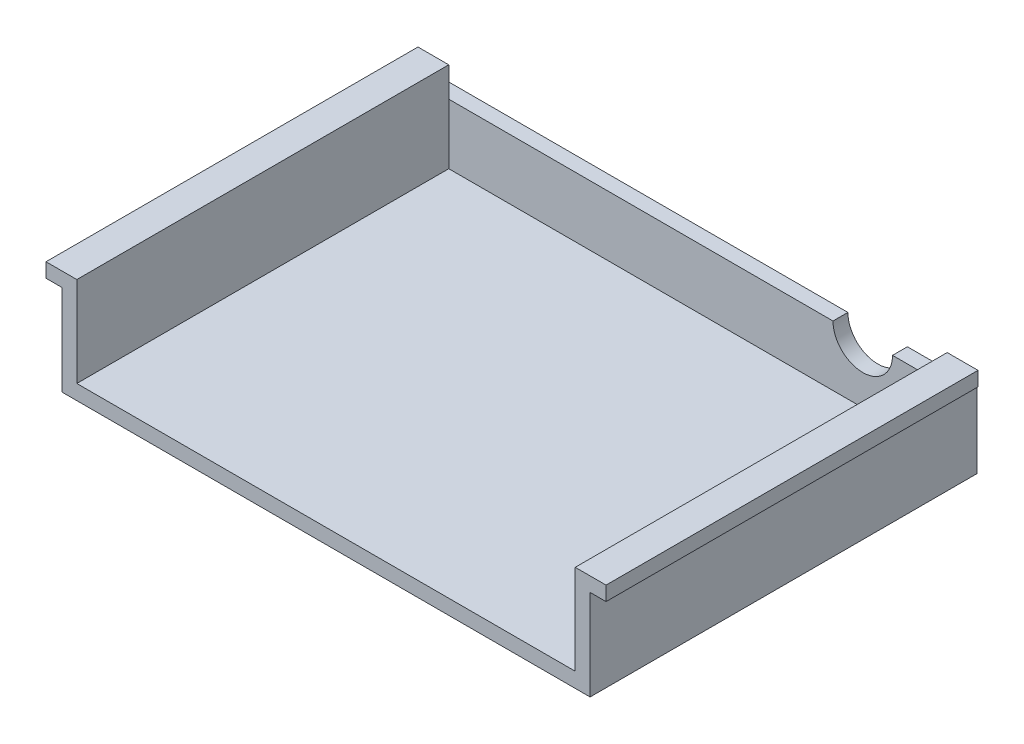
ISO-10303-21;
HEADER;
FILE_DESCRIPTION(('STEP AP214'),'2;1');
FILE_NAME('part.step','',(''),(''),'','','');
FILE_SCHEMA(('AUTOMOTIVE_DESIGN { 1 0 10303 214 1 1 1 1 }'));
ENDSEC;
DATA;
#1=APPLICATION_CONTEXT('core data for automotive mechanical design processes');
#2=APPLICATION_PROTOCOL_DEFINITION('international standard','automotive_design',2000,#1);
#3=PRODUCT_CONTEXT('',#1,'mechanical');
#4=PRODUCT('Part','Part','',(#3));
#5=PRODUCT_RELATED_PRODUCT_CATEGORY('part','',(#4));
#6=PRODUCT_DEFINITION_FORMATION('','',#4);
#7=PRODUCT_DEFINITION_CONTEXT('part definition',#1,'design');
#8=PRODUCT_DEFINITION('design','',#6,#7);
#9=PRODUCT_DEFINITION_SHAPE('','',#8);
#10=(LENGTH_UNIT() NAMED_UNIT(*) SI_UNIT(.MILLI.,.METRE.));
#11=(NAMED_UNIT(*) PLANE_ANGLE_UNIT() SI_UNIT($,.RADIAN.));
#12=(NAMED_UNIT(*) SI_UNIT($,.STERADIAN.) SOLID_ANGLE_UNIT());
#13=UNCERTAINTY_MEASURE_WITH_UNIT(LENGTH_MEASURE(1.E-05),#10,'distance_accuracy_value','');
#14=(GEOMETRIC_REPRESENTATION_CONTEXT(3) GLOBAL_UNCERTAINTY_ASSIGNED_CONTEXT((#13)) GLOBAL_UNIT_ASSIGNED_CONTEXT((#10,
#11,#12)) REPRESENTATION_CONTEXT('',''));
#15=CARTESIAN_POINT('',(0.,0.,0.));
#16=DIRECTION('',(0.,0.,1.));
#17=DIRECTION('',(1.,0.,0.));
#18=AXIS2_PLACEMENT_3D('',#15,#16,#17);
#19=CARTESIAN_POINT('',(-45.4975985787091,1.42388253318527,-1.016));
#20=DIRECTION('',(0.,-1.,0.));
#21=DIRECTION('',(0.,0.,-1.));
#22=AXIS2_PLACEMENT_3D('',#19,#20,#21);
#23=PLANE('',#22);
#24=DIRECTION('',(1.,0.,0.));
#25=VECTOR('',#24,1.);
#26=CARTESIAN_POINT('',(-45.4975985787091,1.42388253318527,0.));
#27=LINE('',#26,#25);
#28=CARTESIAN_POINT('',(-32.1102128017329,1.42388253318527,0.));
#29=VERTEX_POINT('',#28);
#30=CARTESIAN_POINT('',(-5.87201280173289,1.42388253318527,0.));
#31=VERTEX_POINT('',#30);
#32=EDGE_CURVE('E166',#29,#31,#27,.T.);
#33=ORIENTED_EDGE('',*,*,#32,.T.);
#34=DIRECTION('',(0.,0.,-1.));
#35=VECTOR('',#34,1.);
#36=CARTESIAN_POINT('',(-5.87201280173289,1.42388253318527,2.032));
#37=LINE('',#36,#35);
#38=CARTESIAN_POINT('',(-5.87201280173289,1.42388253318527,-1.016));
#39=VERTEX_POINT('',#38);
#40=EDGE_CURVE('E153',#31,#39,#37,.T.);
#41=ORIENTED_EDGE('',*,*,#40,.T.);
#42=DIRECTION('',(1.,0.,0.));
#43=VECTOR('',#42,1.);
#44=CARTESIAN_POINT('',(-45.4975985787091,1.42388253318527,-1.016));
#45=LINE('',#44,#43);
#46=CARTESIAN_POINT('',(-33.1262128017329,1.42388253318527,-1.016));
#47=VERTEX_POINT('',#46);
#48=EDGE_CURVE('E163',#47,#39,#45,.T.);
#49=ORIENTED_EDGE('',*,*,#48,.F.);
#50=DIRECTION('',(0.,0.,1.));
#51=VECTOR('',#50,1.);
#52=CARTESIAN_POINT('',(-33.1262128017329,1.42388253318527,-1.016));
#53=LINE('',#52,#51);
#54=CARTESIAN_POINT('',(-33.1262128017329,1.42388253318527,0.));
#55=VERTEX_POINT('',#54);
#56=EDGE_CURVE('E186',#47,#55,#53,.T.);
#57=ORIENTED_EDGE('',*,*,#56,.T.);
#58=EDGE_CURVE('E180',#55,#29,#27,.T.);
#59=ORIENTED_EDGE('',*,*,#58,.T.);
#60=EDGE_LOOP('',(#33,#41,#49,#57,#59));
#61=FACE_BOUND('',#60,.T.);
#62=ADVANCED_FACE('F32',(#61),#23,.F.);
#63=CARTESIAN_POINT('',(-15.0922128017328,-30.530903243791,0.));
#64=DIRECTION('',(0.,0.,1.));
#65=DIRECTION('',(1.,0.,0.));
#66=AXIS2_PLACEMENT_3D('',#63,#64,#65);
#67=PLANE('',#66);
#68=ORIENTED_EDGE('',*,*,#58,.F.);
#69=DIRECTION('',(0.,1.,0.));
#70=VECTOR('',#69,1.);
#71=CARTESIAN_POINT('',(-33.1262128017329,-30.530903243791,0.));
#72=LINE('',#71,#70);
#73=CARTESIAN_POINT('',(-33.1262128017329,2.47857453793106,0.));
#74=VERTEX_POINT('',#73);
#75=EDGE_CURVE('E223',#55,#74,#72,.T.);
#76=ORIENTED_EDGE('',*,*,#75,.T.);
#77=DIRECTION('',(1.,0.,0.));
#78=VECTOR('',#77,1.);
#79=CARTESIAN_POINT('',(-15.0922128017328,2.47857453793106,0.));
#80=LINE('',#79,#78);
#81=CARTESIAN_POINT('',(-34.2141312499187,2.47857453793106,0.));
#82=VERTEX_POINT('',#81);
#83=EDGE_CURVE('E220',#82,#74,#80,.T.);
#84=ORIENTED_EDGE('',*,*,#83,.F.);
#85=DIRECTION('',(0.,-1.,0.));
#86=VECTOR('',#85,1.);
#87=CARTESIAN_POINT('',(-34.2141312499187,-30.530903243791,0.));
#88=LINE('',#87,#86);
#89=CARTESIAN_POINT('',(-34.2141312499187,3.45588253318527,0.));
#90=VERTEX_POINT('',#89);
#91=EDGE_CURVE('E218',#90,#82,#88,.T.);
#92=ORIENTED_EDGE('',*,*,#91,.F.);
#93=DIRECTION('',(1.,0.,0.));
#94=VECTOR('',#93,1.);
#95=CARTESIAN_POINT('',(-15.0922128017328,3.45588253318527,0.));
#96=LINE('',#95,#94);
#97=CARTESIAN_POINT('',(-32.1102128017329,3.45588253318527,0.));
#98=VERTEX_POINT('',#97);
#99=EDGE_CURVE('E216',#90,#98,#96,.T.);
#100=ORIENTED_EDGE('',*,*,#99,.T.);
#101=DIRECTION('',(0.,1.,0.));
#102=VECTOR('',#101,1.);
#103=CARTESIAN_POINT('',(-32.1102128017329,-30.530903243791,0.));
#104=LINE('',#103,#102);
#105=EDGE_CURVE('E57',#29,#98,#104,.T.);
#106=ORIENTED_EDGE('',*,*,#105,.F.);
#107=EDGE_LOOP('',(#68,#76,#84,#92,#100,#106));
#108=FACE_BOUND('',#107,.T.);
#109=ADVANCED_FACE('F334',(#108),#67,.F.);
#110=CARTESIAN_POINT('',(1.9257871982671,1.42388253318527,0.));
#111=VERTEX_POINT('',#110);
#112=CARTESIAN_POINT('',(2.94178719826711,1.42388253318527,0.));
#113=VERTEX_POINT('',#112);
#114=EDGE_CURVE('E11',#111,#113,#27,.T.);
#115=ORIENTED_EDGE('',*,*,#114,.F.);
#116=DIRECTION('',(0.,1.,0.));
#117=VECTOR('',#116,1.);
#118=CARTESIAN_POINT('',(1.9257871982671,-30.530903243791,0.));
#119=LINE('',#118,#117);
#120=CARTESIAN_POINT('',(1.9257871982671,3.45588253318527,0.));
#121=VERTEX_POINT('',#120);
#122=EDGE_CURVE('E262',#111,#121,#119,.T.);
#123=ORIENTED_EDGE('',*,*,#122,.T.);
#124=DIRECTION('',(-1.,0.,0.));
#125=VECTOR('',#124,1.);
#126=CARTESIAN_POINT('',(-15.0922128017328,3.45588253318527,0.));
#127=LINE('',#126,#125);
#128=CARTESIAN_POINT('',(4.02970564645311,3.45588253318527,0.));
#129=VERTEX_POINT('',#128);
#130=EDGE_CURVE('E263',#129,#121,#127,.T.);
#131=ORIENTED_EDGE('',*,*,#130,.F.);
#132=DIRECTION('',(0.,-1.,0.));
#133=VECTOR('',#132,1.);
#134=CARTESIAN_POINT('',(4.02970564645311,-30.530903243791,0.));
#135=LINE('',#134,#133);
#136=CARTESIAN_POINT('',(4.02970564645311,2.47857453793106,0.));
#137=VERTEX_POINT('',#136);
#138=EDGE_CURVE('E266',#129,#137,#135,.T.);
#139=ORIENTED_EDGE('',*,*,#138,.T.);
#140=DIRECTION('',(-1.,0.,0.));
#141=VECTOR('',#140,1.);
#142=CARTESIAN_POINT('',(-15.0922128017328,2.47857453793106,0.));
#143=LINE('',#142,#141);
#144=CARTESIAN_POINT('',(2.94178719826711,2.47857453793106,0.));
#145=VERTEX_POINT('',#144);
#146=EDGE_CURVE('E231',#137,#145,#143,.T.);
#147=ORIENTED_EDGE('',*,*,#146,.T.);
#148=DIRECTION('',(0.,1.,0.));
#149=VECTOR('',#148,1.);
#150=CARTESIAN_POINT('',(2.94178719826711,-30.530903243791,0.));
#151=LINE('',#150,#149);
#152=EDGE_CURVE('E229',#113,#145,#151,.T.);
#153=ORIENTED_EDGE('',*,*,#152,.F.);
#154=EDGE_LOOP('',(#115,#123,#131,#139,#147,#153));
#155=FACE_BOUND('',#154,.T.);
#156=ADVANCED_FACE('F272',(#155),#67,.F.);
#157=CARTESIAN_POINT('',(-15.0922128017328,-2.69091746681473,25.4));
#158=DIRECTION('',(0.,1.,0.));
#159=DIRECTION('',(0.,0.,1.));
#160=AXIS2_PLACEMENT_3D('',#157,#158,#159);
#161=PLANE('',#160);
#162=DIRECTION('',(1.,0.,0.));
#163=VECTOR('',#162,1.);
#164=CARTESIAN_POINT('',(-15.0922128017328,-2.69091746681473,0.));
#165=LINE('',#164,#163);
#166=CARTESIAN_POINT('',(-32.1102128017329,-2.69091746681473,0.));
#167=VERTEX_POINT('',#166);
#168=CARTESIAN_POINT('',(1.9257871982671,-2.69091746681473,0.));
#169=VERTEX_POINT('',#168);
#170=EDGE_CURVE('E200',#167,#169,#165,.T.);
#171=ORIENTED_EDGE('',*,*,#170,.F.);
#172=DIRECTION('',(0.,0.,-1.));
#173=VECTOR('',#172,1.);
#174=CARTESIAN_POINT('',(-32.1102128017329,-2.69091746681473,25.4));
#175=LINE('',#174,#173);
#176=CARTESIAN_POINT('',(-32.1102128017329,-2.69091746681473,25.4));
#177=VERTEX_POINT('',#176);
#178=EDGE_CURVE('E41',#177,#167,#175,.T.);
#179=ORIENTED_EDGE('',*,*,#178,.F.);
#180=DIRECTION('',(1.,0.,0.));
#181=VECTOR('',#180,1.);
#182=CARTESIAN_POINT('',(-15.0922128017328,-2.69091746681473,25.4));
#183=LINE('',#182,#181);
#184=CARTESIAN_POINT('',(1.9257871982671,-2.69091746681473,25.4));
#185=VERTEX_POINT('',#184);
#186=EDGE_CURVE('E190',#177,#185,#183,.T.);
#187=ORIENTED_EDGE('',*,*,#186,.T.);
#188=DIRECTION('',(0.,0.,-1.));
#189=VECTOR('',#188,1.);
#190=CARTESIAN_POINT('',(1.9257871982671,-2.69091746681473,25.4));
#191=LINE('',#190,#189);
#192=EDGE_CURVE('E258',#185,#169,#191,.T.);
#193=ORIENTED_EDGE('',*,*,#192,.T.);
#194=EDGE_LOOP('',(#171,#179,#187,#193));
#195=FACE_BOUND('',#194,.T.);
#196=ADVANCED_FACE('F34',(#195),#161,.T.);
#197=CARTESIAN_POINT('',(-32.1102128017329,-30.530903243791,25.4));
#198=DIRECTION('',(-1.,0.,0.));
#199=DIRECTION('',(0.,0.,1.));
#200=AXIS2_PLACEMENT_3D('',#197,#198,#199);
#201=PLANE('',#200);
#202=EDGE_CURVE('E210',#167,#29,#104,.T.);
#203=ORIENTED_EDGE('',*,*,#202,.T.);
#204=ORIENTED_EDGE('',*,*,#105,.T.);
#205=DIRECTION('',(0.,0.,-1.));
#206=VECTOR('',#205,1.);
#207=CARTESIAN_POINT('',(-32.1102128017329,3.45588253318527,25.4));
#208=LINE('',#207,#206);
#209=CARTESIAN_POINT('',(-32.1102128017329,3.45588253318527,25.4));
#210=VERTEX_POINT('',#209);
#211=EDGE_CURVE('E233',#210,#98,#208,.T.);
#212=ORIENTED_EDGE('',*,*,#211,.F.);
#213=DIRECTION('',(0.,1.,0.));
#214=VECTOR('',#213,1.);
#215=CARTESIAN_POINT('',(-32.1102128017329,-30.530903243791,25.4));
#216=LINE('',#215,#214);
#217=EDGE_CURVE('E310',#177,#210,#216,.T.);
#218=ORIENTED_EDGE('',*,*,#217,.F.);
#219=ORIENTED_EDGE('',*,*,#178,.T.);
#220=EDGE_LOOP('',(#203,#204,#212,#218,#219));
#221=FACE_BOUND('',#220,.T.);
#222=ADVANCED_FACE('F340',(#221),#201,.F.);
#223=CARTESIAN_POINT('',(-15.0922128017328,3.45588253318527,25.4));
#224=DIRECTION('',(0.,1.,0.));
#225=DIRECTION('',(0.,0.,1.));
#226=AXIS2_PLACEMENT_3D('',#223,#224,#225);
#227=PLANE('',#226);
#228=ORIENTED_EDGE('',*,*,#99,.F.);
#229=DIRECTION('',(0.,0.,-1.));
#230=VECTOR('',#229,1.);
#231=CARTESIAN_POINT('',(-34.2141312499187,3.45588253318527,25.4));
#232=LINE('',#231,#230);
#233=CARTESIAN_POINT('',(-34.2141312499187,3.45588253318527,25.4));
#234=VERTEX_POINT('',#233);
#235=EDGE_CURVE('E236',#234,#90,#232,.T.);
#236=ORIENTED_EDGE('',*,*,#235,.F.);
#237=DIRECTION('',(1.,0.,0.));
#238=VECTOR('',#237,1.);
#239=CARTESIAN_POINT('',(-15.0922128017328,3.45588253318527,25.4));
#240=LINE('',#239,#238);
#241=EDGE_CURVE('E313',#234,#210,#240,.T.);
#242=ORIENTED_EDGE('',*,*,#241,.T.);
#243=ORIENTED_EDGE('',*,*,#211,.T.);
#244=EDGE_LOOP('',(#228,#236,#242,#243));
#245=FACE_BOUND('',#244,.T.);
#246=ADVANCED_FACE('F338',(#245),#227,.T.);
#247=CARTESIAN_POINT('',(-34.2141312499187,-30.530903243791,25.4));
#248=DIRECTION('',(1.,0.,0.));
#249=DIRECTION('',(0.,0.,-1.));
#250=AXIS2_PLACEMENT_3D('',#247,#248,#249);
#251=PLANE('',#250);
#252=ORIENTED_EDGE('',*,*,#91,.T.);
#253=DIRECTION('',(0.,0.,-1.));
#254=VECTOR('',#253,1.);
#255=CARTESIAN_POINT('',(-34.2141312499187,2.47857453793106,25.4));
#256=LINE('',#255,#254);
#257=CARTESIAN_POINT('',(-34.2141312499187,2.47857453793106,25.4));
#258=VERTEX_POINT('',#257);
#259=EDGE_CURVE('E238',#258,#82,#256,.T.);
#260=ORIENTED_EDGE('',*,*,#259,.F.);
#261=DIRECTION('',(0.,-1.,0.));
#262=VECTOR('',#261,1.);
#263=CARTESIAN_POINT('',(-34.2141312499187,-30.530903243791,25.4));
#264=LINE('',#263,#262);
#265=EDGE_CURVE('E315',#234,#258,#264,.T.);
#266=ORIENTED_EDGE('',*,*,#265,.F.);
#267=ORIENTED_EDGE('',*,*,#235,.T.);
#268=EDGE_LOOP('',(#252,#260,#266,#267));
#269=FACE_BOUND('',#268,.T.);
#270=ADVANCED_FACE('F495',(#269),#251,.F.);
#271=CARTESIAN_POINT('',(-15.0922128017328,2.47857453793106,25.4));
#272=DIRECTION('',(0.,1.,0.));
#273=DIRECTION('',(0.,0.,1.));
#274=AXIS2_PLACEMENT_3D('',#271,#272,#273);
#275=PLANE('',#274);
#276=ORIENTED_EDGE('',*,*,#83,.T.);
#277=DIRECTION('',(0.,0.,-1.));
#278=VECTOR('',#277,1.);
#279=CARTESIAN_POINT('',(-33.1262128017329,2.47857453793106,25.4));
#280=LINE('',#279,#278);
#281=CARTESIAN_POINT('',(-33.1262128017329,2.47857453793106,25.4));
#282=VERTEX_POINT('',#281);
#283=EDGE_CURVE('E241',#282,#74,#280,.T.);
#284=ORIENTED_EDGE('',*,*,#283,.F.);
#285=DIRECTION('',(1.,0.,0.));
#286=VECTOR('',#285,1.);
#287=CARTESIAN_POINT('',(-15.0922128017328,2.47857453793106,25.4));
#288=LINE('',#287,#286);
#289=EDGE_CURVE('E319',#258,#282,#288,.T.);
#290=ORIENTED_EDGE('',*,*,#289,.F.);
#291=ORIENTED_EDGE('',*,*,#259,.T.);
#292=EDGE_LOOP('',(#276,#284,#290,#291));
#293=FACE_BOUND('',#292,.T.);
#294=ADVANCED_FACE('F331',(#293),#275,.F.);
#295=CARTESIAN_POINT('',(-33.1262128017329,-30.530903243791,25.4));
#296=DIRECTION('',(-1.,0.,0.));
#297=DIRECTION('',(0.,0.,1.));
#298=AXIS2_PLACEMENT_3D('',#295,#296,#297);
#299=PLANE('',#298);
#300=ORIENTED_EDGE('',*,*,#75,.F.);
#301=ORIENTED_EDGE('',*,*,#56,.F.);
#302=DIRECTION('',(0.,1.,0.));
#303=VECTOR('',#302,1.);
#304=CARTESIAN_POINT('',(-33.1262128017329,-0.125517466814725,-1.016));
#305=LINE('',#304,#303);
#306=CARTESIAN_POINT('',(-33.1262128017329,-3.70691746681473,-1.016));
#307=VERTEX_POINT('',#306);
#308=EDGE_CURVE('E172',#307,#47,#305,.T.);
#309=ORIENTED_EDGE('',*,*,#308,.F.);
#310=DIRECTION('',(0.,0.,-1.));
#311=VECTOR('',#310,1.);
#312=CARTESIAN_POINT('',(-33.1262128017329,-3.70691746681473,25.4));
#313=LINE('',#312,#311);
#314=CARTESIAN_POINT('',(-33.1262128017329,-3.70691746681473,25.4));
#315=VERTEX_POINT('',#314);
#316=EDGE_CURVE('E244',#315,#307,#313,.T.);
#317=ORIENTED_EDGE('',*,*,#316,.F.);
#318=DIRECTION('',(0.,1.,0.));
#319=VECTOR('',#318,1.);
#320=CARTESIAN_POINT('',(-33.1262128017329,-30.530903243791,25.4));
#321=LINE('',#320,#319);
#322=EDGE_CURVE('E290',#315,#282,#321,.T.);
#323=ORIENTED_EDGE('',*,*,#322,.T.);
#324=ORIENTED_EDGE('',*,*,#283,.T.);
#325=EDGE_LOOP('',(#300,#301,#309,#317,#323,#324));
#326=FACE_BOUND('',#325,.T.);
#327=ADVANCED_FACE('F324',(#326),#299,.T.);
#328=CARTESIAN_POINT('',(-15.0922128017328,-3.70691746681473,25.4));
#329=DIRECTION('',(0.,1.,0.));
#330=DIRECTION('',(0.,0.,1.));
#331=AXIS2_PLACEMENT_3D('',#328,#329,#330);
#332=PLANE('',#331);
#333=ORIENTED_EDGE('',*,*,#316,.T.);
#334=DIRECTION('',(-1.,0.,0.));
#335=VECTOR('',#334,1.);
#336=CARTESIAN_POINT('',(-45.4975985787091,-3.70691746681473,-1.016));
#337=LINE('',#336,#335);
#338=CARTESIAN_POINT('',(2.94178719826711,-3.70691746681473,-1.016));
#339=VERTEX_POINT('',#338);
#340=EDGE_CURVE('E178',#339,#307,#337,.T.);
#341=ORIENTED_EDGE('',*,*,#340,.F.);
#342=DIRECTION('',(0.,0.,-1.));
#343=VECTOR('',#342,1.);
#344=CARTESIAN_POINT('',(2.94178719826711,-3.70691746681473,25.4));
#345=LINE('',#344,#343);
#346=CARTESIAN_POINT('',(2.94178719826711,-3.70691746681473,25.4));
#347=VERTEX_POINT('',#346);
#348=EDGE_CURVE('E246',#347,#339,#345,.T.);
#349=ORIENTED_EDGE('',*,*,#348,.F.);
#350=DIRECTION('',(1.,0.,0.));
#351=VECTOR('',#350,1.);
#352=CARTESIAN_POINT('',(-15.0922128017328,-3.70691746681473,25.4));
#353=LINE('',#352,#351);
#354=EDGE_CURVE('E286',#315,#347,#353,.T.);
#355=ORIENTED_EDGE('',*,*,#354,.F.);
#356=EDGE_LOOP('',(#333,#341,#349,#355));
#357=FACE_BOUND('',#356,.T.);
#358=ADVANCED_FACE('F413',(#357),#332,.F.);
#359=CARTESIAN_POINT('',(2.94178719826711,-30.530903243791,25.4));
#360=DIRECTION('',(-1.,0.,0.));
#361=DIRECTION('',(0.,0.,1.));
#362=AXIS2_PLACEMENT_3D('',#359,#360,#361);
#363=PLANE('',#362);
#364=ORIENTED_EDGE('',*,*,#348,.T.);
#365=DIRECTION('',(0.,-1.,0.));
#366=VECTOR('',#365,1.);
#367=CARTESIAN_POINT('',(2.94178719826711,-0.125517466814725,-1.016));
#368=LINE('',#367,#366);
#369=CARTESIAN_POINT('',(2.94178719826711,1.42388253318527,-1.016));
#370=VERTEX_POINT('',#369);
#371=EDGE_CURVE('E174',#370,#339,#368,.T.);
#372=ORIENTED_EDGE('',*,*,#371,.F.);
#373=DIRECTION('',(0.,0.,1.));
#374=VECTOR('',#373,1.);
#375=CARTESIAN_POINT('',(2.94178719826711,1.42388253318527,-1.016));
#376=LINE('',#375,#374);
#377=EDGE_CURVE('E198',#370,#113,#376,.T.);
#378=ORIENTED_EDGE('',*,*,#377,.T.);
#379=ORIENTED_EDGE('',*,*,#152,.T.);
#380=DIRECTION('',(0.,0.,-1.));
#381=VECTOR('',#380,1.);
#382=CARTESIAN_POINT('',(2.94178719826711,2.47857453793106,25.4));
#383=LINE('',#382,#381);
#384=CARTESIAN_POINT('',(2.94178719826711,2.47857453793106,25.4));
#385=VERTEX_POINT('',#384);
#386=EDGE_CURVE('E248',#385,#145,#383,.T.);
#387=ORIENTED_EDGE('',*,*,#386,.F.);
#388=DIRECTION('',(0.,1.,0.));
#389=VECTOR('',#388,1.);
#390=CARTESIAN_POINT('',(2.94178719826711,-30.530903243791,25.4));
#391=LINE('',#390,#389);
#392=EDGE_CURVE('E283',#347,#385,#391,.T.);
#393=ORIENTED_EDGE('',*,*,#392,.F.);
#394=EDGE_LOOP('',(#364,#372,#378,#379,#387,#393));
#395=FACE_BOUND('',#394,.T.);
#396=ADVANCED_FACE('F282',(#395),#363,.F.);
#397=CARTESIAN_POINT('',(-15.0922128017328,2.47857453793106,25.4));
#398=DIRECTION('',(0.,-1.,0.));
#399=DIRECTION('',(0.,0.,-1.));
#400=AXIS2_PLACEMENT_3D('',#397,#398,#399);
#401=PLANE('',#400);
#402=ORIENTED_EDGE('',*,*,#146,.F.);
#403=DIRECTION('',(0.,0.,-1.));
#404=VECTOR('',#403,1.);
#405=CARTESIAN_POINT('',(4.02970564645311,2.47857453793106,25.4));
#406=LINE('',#405,#404);
#407=CARTESIAN_POINT('',(4.02970564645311,2.47857453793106,25.4));
#408=VERTEX_POINT('',#407);
#409=EDGE_CURVE('E251',#408,#137,#406,.T.);
#410=ORIENTED_EDGE('',*,*,#409,.F.);
#411=DIRECTION('',(-1.,0.,0.));
#412=VECTOR('',#411,1.);
#413=CARTESIAN_POINT('',(-15.0922128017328,2.47857453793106,25.4));
#414=LINE('',#413,#412);
#415=EDGE_CURVE('E280',#408,#385,#414,.T.);
#416=ORIENTED_EDGE('',*,*,#415,.T.);
#417=ORIENTED_EDGE('',*,*,#386,.T.);
#418=EDGE_LOOP('',(#402,#410,#416,#417));
#419=FACE_BOUND('',#418,.T.);
#420=ADVANCED_FACE('F276',(#419),#401,.T.);
#421=CARTESIAN_POINT('',(4.02970564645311,-30.530903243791,25.4));
#422=DIRECTION('',(1.,0.,0.));
#423=DIRECTION('',(0.,0.,-1.));
#424=AXIS2_PLACEMENT_3D('',#421,#422,#423);
#425=PLANE('',#424);
#426=ORIENTED_EDGE('',*,*,#138,.F.);
#427=DIRECTION('',(0.,0.,-1.));
#428=VECTOR('',#427,1.);
#429=CARTESIAN_POINT('',(4.02970564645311,3.45588253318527,25.4));
#430=LINE('',#429,#428);
#431=CARTESIAN_POINT('',(4.02970564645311,3.45588253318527,25.4));
#432=VERTEX_POINT('',#431);
#433=EDGE_CURVE('E253',#432,#129,#430,.T.);
#434=ORIENTED_EDGE('',*,*,#433,.F.);
#435=DIRECTION('',(0.,-1.,0.));
#436=VECTOR('',#435,1.);
#437=CARTESIAN_POINT('',(4.02970564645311,-30.530903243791,25.4));
#438=LINE('',#437,#436);
#439=EDGE_CURVE('E288',#432,#408,#438,.T.);
#440=ORIENTED_EDGE('',*,*,#439,.T.);
#441=ORIENTED_EDGE('',*,*,#409,.T.);
#442=EDGE_LOOP('',(#426,#434,#440,#441));
#443=FACE_BOUND('',#442,.T.);
#444=ADVANCED_FACE('F347',(#443),#425,.T.);
#445=CARTESIAN_POINT('',(-15.0922128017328,3.45588253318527,25.4));
#446=DIRECTION('',(0.,-1.,0.));
#447=DIRECTION('',(0.,0.,-1.));
#448=AXIS2_PLACEMENT_3D('',#445,#446,#447);
#449=PLANE('',#448);
#450=ORIENTED_EDGE('',*,*,#130,.T.);
#451=DIRECTION('',(0.,0.,-1.));
#452=VECTOR('',#451,1.);
#453=CARTESIAN_POINT('',(1.9257871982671,3.45588253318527,25.4));
#454=LINE('',#453,#452);
#455=CARTESIAN_POINT('',(1.9257871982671,3.45588253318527,25.4));
#456=VERTEX_POINT('',#455);
#457=EDGE_CURVE('E255',#456,#121,#454,.T.);
#458=ORIENTED_EDGE('',*,*,#457,.F.);
#459=DIRECTION('',(-1.,0.,0.));
#460=VECTOR('',#459,1.);
#461=CARTESIAN_POINT('',(-15.0922128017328,3.45588253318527,25.4));
#462=LINE('',#461,#460);
#463=EDGE_CURVE('E295',#432,#456,#462,.T.);
#464=ORIENTED_EDGE('',*,*,#463,.F.);
#465=ORIENTED_EDGE('',*,*,#433,.T.);
#466=EDGE_LOOP('',(#450,#458,#464,#465));
#467=FACE_BOUND('',#466,.T.);
#468=ADVANCED_FACE('F348',(#467),#449,.F.);
#469=CARTESIAN_POINT('',(1.9257871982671,-30.530903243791,25.4));
#470=DIRECTION('',(-1.,0.,0.));
#471=DIRECTION('',(0.,0.,1.));
#472=AXIS2_PLACEMENT_3D('',#469,#470,#471);
#473=PLANE('',#472);
#474=EDGE_CURVE('E260',#169,#111,#119,.T.);
#475=ORIENTED_EDGE('',*,*,#474,.F.);
#476=ORIENTED_EDGE('',*,*,#192,.F.);
#477=DIRECTION('',(0.,1.,0.));
#478=VECTOR('',#477,1.);
#479=CARTESIAN_POINT('',(1.9257871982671,-30.530903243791,25.4));
#480=LINE('',#479,#478);
#481=EDGE_CURVE('E213',#185,#456,#480,.T.);
#482=ORIENTED_EDGE('',*,*,#481,.T.);
#483=ORIENTED_EDGE('',*,*,#457,.T.);
#484=ORIENTED_EDGE('',*,*,#122,.F.);
#485=EDGE_LOOP('',(#475,#476,#482,#483,#484));
#486=FACE_BOUND('',#485,.T.);
#487=ADVANCED_FACE('F303',(#486),#473,.T.);
#488=CARTESIAN_POINT('',(-15.0922128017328,-30.530903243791,25.4));
#489=DIRECTION('',(0.,0.,1.));
#490=DIRECTION('',(1.,0.,0.));
#491=AXIS2_PLACEMENT_3D('',#488,#489,#490);
#492=PLANE('',#491);
#493=ORIENTED_EDGE('',*,*,#186,.F.);
#494=ORIENTED_EDGE('',*,*,#217,.T.);
#495=ORIENTED_EDGE('',*,*,#241,.F.);
#496=ORIENTED_EDGE('',*,*,#265,.T.);
#497=ORIENTED_EDGE('',*,*,#289,.T.);
#498=ORIENTED_EDGE('',*,*,#322,.F.);
#499=ORIENTED_EDGE('',*,*,#354,.T.);
#500=ORIENTED_EDGE('',*,*,#392,.T.);
#501=ORIENTED_EDGE('',*,*,#415,.F.);
#502=ORIENTED_EDGE('',*,*,#439,.F.);
#503=ORIENTED_EDGE('',*,*,#463,.T.);
#504=ORIENTED_EDGE('',*,*,#481,.F.);
#505=EDGE_LOOP('',(#493,#494,#495,#496,#497,#498,#499,#500,#501,#502,#503,#504));
#506=FACE_BOUND('',#505,.T.);
#507=ADVANCED_FACE('F307',(#506),#492,.T.);
#508=CARTESIAN_POINT('',(-45.4975985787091,-0.125517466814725,0.));
#509=DIRECTION('',(0.,0.,-1.));
#510=DIRECTION('',(-1.,0.,0.));
#511=AXIS2_PLACEMENT_3D('',#508,#509,#510);
#512=PLANE('',#511);
#513=CARTESIAN_POINT('',(-1.8080128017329,1.42388253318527,0.));
#514=VERTEX_POINT('',#513);
#515=EDGE_CURVE('E189',#514,#111,#27,.T.);
#516=ORIENTED_EDGE('',*,*,#515,.F.);
#517=CARTESIAN_POINT('',(-3.84001280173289,1.42388253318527,0.));
#518=DIRECTION('',(0.,0.,-1.));
#519=DIRECTION('',(-1.,0.,0.));
#520=AXIS2_PLACEMENT_3D('',#517,#518,#519);
#521=CIRCLE('',#520,2.032);
#522=EDGE_CURVE('E167',#514,#31,#521,.T.);
#523=ORIENTED_EDGE('',*,*,#522,.T.);
#524=ORIENTED_EDGE('',*,*,#32,.F.);
#525=ORIENTED_EDGE('',*,*,#202,.F.);
#526=ORIENTED_EDGE('',*,*,#170,.T.);
#527=ORIENTED_EDGE('',*,*,#474,.T.);
#528=EDGE_LOOP('',(#516,#523,#524,#525,#526,#527));
#529=FACE_BOUND('',#528,.T.);
#530=ADVANCED_FACE('F342',(#529),#512,.F.);
#531=CARTESIAN_POINT('',(-1.8080128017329,1.42388253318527,-1.016));
#532=VERTEX_POINT('',#531);
#533=EDGE_CURVE('E175',#532,#370,#45,.T.);
#534=ORIENTED_EDGE('',*,*,#533,.F.);
#535=DIRECTION('',(0.,0.,-1.));
#536=VECTOR('',#535,1.);
#537=CARTESIAN_POINT('',(-1.8080128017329,1.42388253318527,2.032));
#538=LINE('',#537,#536);
#539=EDGE_CURVE('E49',#514,#532,#538,.T.);
#540=ORIENTED_EDGE('',*,*,#539,.F.);
#541=ORIENTED_EDGE('',*,*,#515,.T.);
#542=ORIENTED_EDGE('',*,*,#114,.T.);
#543=ORIENTED_EDGE('',*,*,#377,.F.);
#544=EDGE_LOOP('',(#534,#540,#541,#542,#543));
#545=FACE_BOUND('',#544,.T.);
#546=ADVANCED_FACE('F344',(#545),#23,.F.);
#547=CARTESIAN_POINT('',(-45.4975985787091,-0.125517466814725,-1.016));
#548=DIRECTION('',(0.,0.,-1.));
#549=DIRECTION('',(-1.,0.,0.));
#550=AXIS2_PLACEMENT_3D('',#547,#548,#549);
#551=PLANE('',#550);
#552=CARTESIAN_POINT('',(-3.84001280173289,1.42388253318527,-1.016));
#553=DIRECTION('',(0.,0.,-1.));
#554=DIRECTION('',(-1.,0.,0.));
#555=AXIS2_PLACEMENT_3D('',#552,#553,#554);
#556=CIRCLE('',#555,2.032);
#557=EDGE_CURVE('E150',#532,#39,#556,.T.);
#558=ORIENTED_EDGE('',*,*,#557,.F.);
#559=ORIENTED_EDGE('',*,*,#533,.T.);
#560=ORIENTED_EDGE('',*,*,#371,.T.);
#561=ORIENTED_EDGE('',*,*,#340,.T.);
#562=ORIENTED_EDGE('',*,*,#308,.T.);
#563=ORIENTED_EDGE('',*,*,#48,.T.);
#564=EDGE_LOOP('',(#558,#559,#560,#561,#562,#563));
#565=FACE_BOUND('',#564,.T.);
#566=ADVANCED_FACE('F169',(#565),#551,.T.);
#567=CARTESIAN_POINT('',(-3.84001280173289,1.42388253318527,2.032));
#568=DIRECTION('',(0.,0.,-1.));
#569=DIRECTION('',(-1.,0.,0.));
#570=AXIS2_PLACEMENT_3D('',#567,#568,#569);
#571=CYLINDRICAL_SURFACE('',#570,2.032);
#572=ORIENTED_EDGE('',*,*,#539,.T.);
#573=ORIENTED_EDGE('',*,*,#557,.T.);
#574=ORIENTED_EDGE('',*,*,#40,.F.);
#575=ORIENTED_EDGE('',*,*,#522,.F.);
#576=EDGE_LOOP('',(#572,#573,#574,#575));
#577=FACE_BOUND('',#576,.T.);
#578=ADVANCED_FACE('F152',(#577),#571,.F.);
#579=CLOSED_SHELL('',(#62,#109,#156,#196,#222,#246,#270,#294,#327,#358,#396,#420,#444,#468,#487,
#507,#530,#546,#566,#578));
#580=MANIFOLD_SOLID_BREP('B2',#579);
#581=ADVANCED_BREP_SHAPE_REPRESENTATION('',(#18,#580),#14);
#582=SHAPE_DEFINITION_REPRESENTATION(#9,#581);
ENDSEC;
END-ISO-10303-21;
